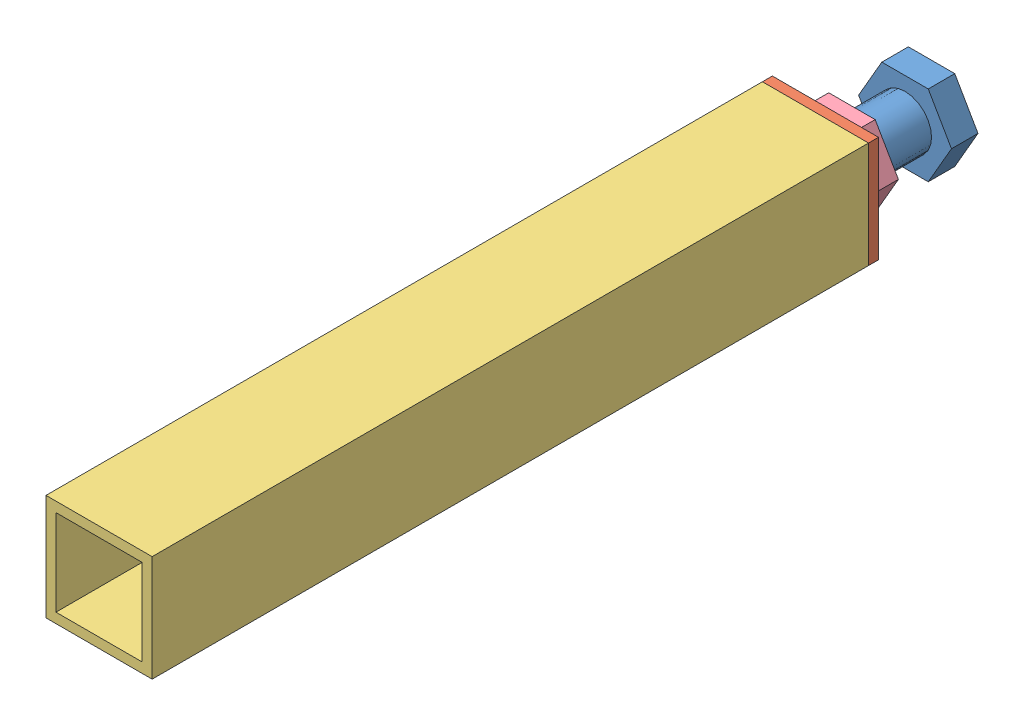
SolidWorks assembly Assem3.sldasm, configuration Default (file format 4400). Lengths in mm.
Overall size (50.8 50.8 398.46).
4 component instances, 4 part files, 9 mates.
Components (placement in the parent):
- bolt-1: bolt.SLDPRT [Default] at (-9.2425 35.5714 -19.2895) size (44.45 38.49 169.67)
- leg cap-1: leg cap.SLDPRT [Default] at (-9.2425 35.5714 36.273) x (1 0 0) z (0 1 0) size (50.8 4.76 50.8)
- leg tube long-1: leg tube long.SLDPRT [Default] at (-9.2425 10.1714 207.723) x (1 0 0) z (0 1 0) size (50.8 342.9 50.8)
- nut-1: nut.SLDPRT [Default] at (-9.2425 35.5714 18.8105) size (44.45 38.49 12.7)
Mates (geometry in assembly coordinates):
- Coincident1: coincident anti-aligned: plane of leg cap-1 through (16.1575 60.9714 31.5105) normal (0 0 -1); plane of nut-1 through (1.87 16.3239 31.5105) normal (0 0 1)
- Concentric1: concentric anti-aligned: circle of leg cap-1; cylinder of nut-1 through (-9.2425 35.5714 18.8105) axis (0 0 1) radius 12.8107
- Concentric2: concentric anti-aligned: cylinder of bolt-1 through (-9.2425 35.5714 150.3825) axis (0 0 -1) radius 12.7; cylinder of nut-1 through (-9.2425 35.5714 18.8105) axis (0 0 1) radius 12.8107
- Distance1: distance = 25.4 mm anti-aligned: plane of nut-1 through (1.87 16.3239 18.8105) normal (0 0 -1); plane of bolt-1 through (1.87 16.3239 -6.5895) normal (0 0 1)
- Parallel1: parallel aligned: plane of leg cap-1 through (-34.6425 60.9714 36.273) normal (0 1 0); plane of nut-1 through (1.87 54.8188 18.8105) normal (0 1 0)
- Parallel2: parallel aligned: plane of bolt-1 through (1.87 54.8188 -19.2895) normal (0 1 0); plane of nut-1 through (1.87 54.8188 18.8105) normal (0 1 0)
- Coincident5: coincident: plane of leg cap-1 through (16.1575 60.9714 36.273) normal (0 0 1); plane of leg tube long-1 through (16.1575 10.1714 36.273) normal (0 0 -1)
- Coincident6: coincident: plane of leg cap-1 through (-34.6425 60.9714 36.273) normal (0 1 0); plane of leg tube long-1 through (-34.6425 60.9714 379.173) normal (0 1 0)
- Coincident7: coincident aligned: plane of leg cap-1 through (16.1575 60.9714 36.273) normal (1 0 0); plane of leg tube long-1 through (16.1575 60.9714 379.173) normal (1 0 0)
